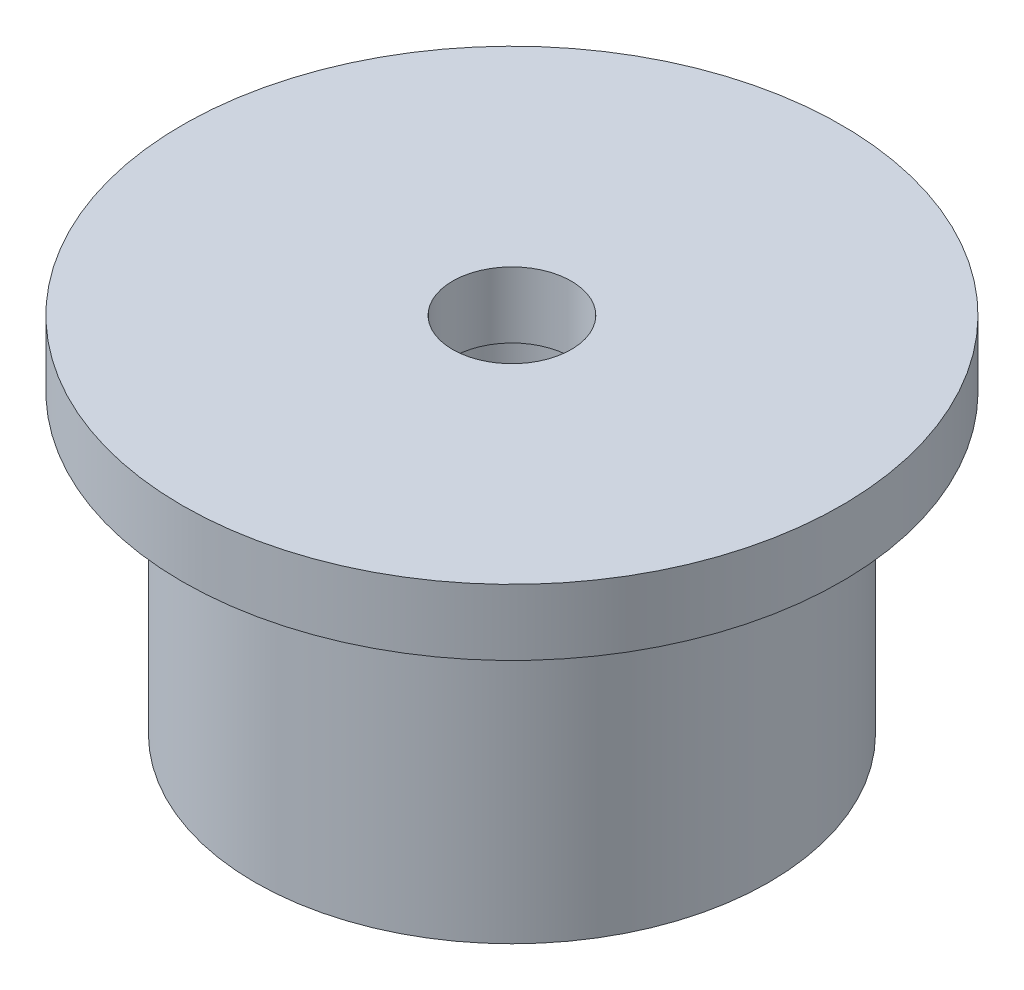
ISO-10303-21;
HEADER;
FILE_DESCRIPTION(('STEP AP214'),'2;1');
FILE_NAME('part.step','',(''),(''),'','','');
FILE_SCHEMA(('AUTOMOTIVE_DESIGN { 1 0 10303 214 1 1 1 1 }'));
ENDSEC;
DATA;
#1=APPLICATION_CONTEXT('core data for automotive mechanical design processes');
#2=APPLICATION_PROTOCOL_DEFINITION('international standard','automotive_design',2000,#1);
#3=PRODUCT_CONTEXT('',#1,'mechanical');
#4=PRODUCT('Part','Part','',(#3));
#5=PRODUCT_RELATED_PRODUCT_CATEGORY('part','',(#4));
#6=PRODUCT_DEFINITION_FORMATION('','',#4);
#7=PRODUCT_DEFINITION_CONTEXT('part definition',#1,'design');
#8=PRODUCT_DEFINITION('design','',#6,#7);
#9=PRODUCT_DEFINITION_SHAPE('','',#8);
#10=(LENGTH_UNIT() NAMED_UNIT(*) SI_UNIT(.MILLI.,.METRE.));
#11=(NAMED_UNIT(*) PLANE_ANGLE_UNIT() SI_UNIT($,.RADIAN.));
#12=(NAMED_UNIT(*) SI_UNIT($,.STERADIAN.) SOLID_ANGLE_UNIT());
#13=UNCERTAINTY_MEASURE_WITH_UNIT(LENGTH_MEASURE(1.E-05),#10,'distance_accuracy_value','');
#14=(GEOMETRIC_REPRESENTATION_CONTEXT(3) GLOBAL_UNCERTAINTY_ASSIGNED_CONTEXT((#13)) GLOBAL_UNIT_ASSIGNED_CONTEXT((#10,
#11,#12)) REPRESENTATION_CONTEXT('',''));
#15=CARTESIAN_POINT('',(0.,0.,0.));
#16=DIRECTION('',(0.,0.,1.));
#17=DIRECTION('',(1.,0.,0.));
#18=AXIS2_PLACEMENT_3D('',#15,#16,#17);
#19=CARTESIAN_POINT('',(0.,-0.5,0.));
#20=DIRECTION('',(0.,1.,0.));
#21=DIRECTION('',(0.,0.,1.));
#22=AXIS2_PLACEMENT_3D('',#19,#20,#21);
#23=PLANE('',#22);
#24=CARTESIAN_POINT('',(0.,-0.5,0.));
#25=DIRECTION('',(0.,1.,0.));
#26=DIRECTION('',(0.,0.,1.));
#27=AXIS2_PLACEMENT_3D('',#24,#25,#26);
#28=CIRCLE('',#27,5.);
#29=CARTESIAN_POINT('',(0.,-0.5,5.));
#30=VERTEX_POINT('',#29);
#31=EDGE_CURVE('E49',#30,#30,#28,.T.);
#32=ORIENTED_EDGE('',*,*,#31,.F.);
#33=EDGE_LOOP('',(#32));
#34=FACE_BOUND('',#33,.T.);
#35=CARTESIAN_POINT('',(0.,-0.5,0.));
#36=DIRECTION('',(0.,1.,0.));
#37=DIRECTION('',(0.,0.,1.));
#38=AXIS2_PLACEMENT_3D('',#35,#36,#37);
#39=CIRCLE('',#38,3.9);
#40=CARTESIAN_POINT('',(0.,-0.5,3.9));
#41=VERTEX_POINT('',#40);
#42=EDGE_CURVE('E42',#41,#41,#39,.F.);
#43=ORIENTED_EDGE('',*,*,#42,.F.);
#44=EDGE_LOOP('',(#43));
#45=FACE_BOUND('',#44,.T.);
#46=ADVANCED_FACE('F31',(#34,#45),#23,.F.);
#47=CARTESIAN_POINT('',(0.,0.5,0.));
#48=DIRECTION('',(0.,-1.,0.));
#49=DIRECTION('',(0.,0.,-1.));
#50=AXIS2_PLACEMENT_3D('',#47,#48,#49);
#51=CYLINDRICAL_SURFACE('',#50,5.);
#52=CARTESIAN_POINT('',(0.,0.5,0.));
#53=DIRECTION('',(0.,1.,0.));
#54=DIRECTION('',(0.,0.,1.));
#55=AXIS2_PLACEMENT_3D('',#52,#53,#54);
#56=CIRCLE('',#55,5.);
#57=CARTESIAN_POINT('',(0.,0.5,5.));
#58=VERTEX_POINT('',#57);
#59=EDGE_CURVE('E46',#58,#58,#56,.T.);
#60=ORIENTED_EDGE('',*,*,#59,.F.);
#61=EDGE_LOOP('',(#60));
#62=FACE_BOUND('',#61,.T.);
#63=ORIENTED_EDGE('',*,*,#31,.T.);
#64=EDGE_LOOP('',(#63));
#65=FACE_BOUND('',#64,.T.);
#66=ADVANCED_FACE('F73',(#62,#65),#51,.T.);
#67=CARTESIAN_POINT('',(0.,0.5,0.));
#68=DIRECTION('',(0.,1.,0.));
#69=DIRECTION('',(0.,0.,1.));
#70=AXIS2_PLACEMENT_3D('',#67,#68,#69);
#71=PLANE('',#70);
#72=CARTESIAN_POINT('',(0.,0.5,0.));
#73=DIRECTION('',(0.,1.,0.));
#74=DIRECTION('',(0.,0.,1.));
#75=AXIS2_PLACEMENT_3D('',#72,#73,#74);
#76=CIRCLE('',#75,0.9);
#77=CARTESIAN_POINT('',(0.,0.5,0.9));
#78=VERTEX_POINT('',#77);
#79=EDGE_CURVE('E60',#78,#78,#76,.T.);
#80=ORIENTED_EDGE('',*,*,#79,.F.);
#81=EDGE_LOOP('',(#80));
#82=FACE_BOUND('',#81,.T.);
#83=ORIENTED_EDGE('',*,*,#59,.T.);
#84=EDGE_LOOP('',(#83));
#85=FACE_BOUND('',#84,.T.);
#86=ADVANCED_FACE('F69',(#82,#85),#71,.T.);
#87=CARTESIAN_POINT('',(0.,-5.,0.));
#88=DIRECTION('',(0.,1.,0.));
#89=DIRECTION('',(0.,0.,1.));
#90=AXIS2_PLACEMENT_3D('',#87,#88,#89);
#91=CYLINDRICAL_SURFACE('',#90,3.9);
#92=CARTESIAN_POINT('',(0.,-5.,0.));
#93=DIRECTION('',(0.,-1.,0.));
#94=DIRECTION('',(0.,0.,-1.));
#95=AXIS2_PLACEMENT_3D('',#92,#93,#94);
#96=CIRCLE('',#95,3.9);
#97=CARTESIAN_POINT('',(0.,-5.,-3.9));
#98=VERTEX_POINT('',#97);
#99=EDGE_CURVE('E52',#98,#98,#96,.T.);
#100=ORIENTED_EDGE('',*,*,#99,.F.);
#101=EDGE_LOOP('',(#100));
#102=FACE_BOUND('',#101,.T.);
#103=ORIENTED_EDGE('',*,*,#42,.T.);
#104=EDGE_LOOP('',(#103));
#105=FACE_BOUND('',#104,.T.);
#106=ADVANCED_FACE('F72',(#102,#105),#91,.T.);
#107=CARTESIAN_POINT('',(0.,-5.,0.));
#108=DIRECTION('',(0.,-1.,0.));
#109=DIRECTION('',(0.,0.,-1.));
#110=AXIS2_PLACEMENT_3D('',#107,#108,#109);
#111=PLANE('',#110);
#112=CARTESIAN_POINT('',(0.,-5.,0.));
#113=DIRECTION('',(0.,-1.,0.));
#114=DIRECTION('',(0.,0.,-1.));
#115=AXIS2_PLACEMENT_3D('',#112,#113,#114);
#116=CIRCLE('',#115,1.2);
#117=CARTESIAN_POINT('',(0.,-5.,-1.2));
#118=VERTEX_POINT('',#117);
#119=EDGE_CURVE('E10',#118,#118,#116,.F.);
#120=ORIENTED_EDGE('',*,*,#119,.T.);
#121=EDGE_LOOP('',(#120));
#122=FACE_BOUND('',#121,.T.);
#123=ORIENTED_EDGE('',*,*,#99,.T.);
#124=EDGE_LOOP('',(#123));
#125=FACE_BOUND('',#124,.T.);
#126=ADVANCED_FACE('F87',(#122,#125),#111,.T.);
#127=CARTESIAN_POINT('',(0.,-0.5,0.));
#128=DIRECTION('',(0.,-1.,0.));
#129=DIRECTION('',(0.,0.,-1.));
#130=AXIS2_PLACEMENT_3D('',#127,#128,#129);
#131=CYLINDRICAL_SURFACE('',#130,1.);
#132=CARTESIAN_POINT('',(0.,-4.8,0.));
#133=DIRECTION('',(0.,-1.,0.));
#134=DIRECTION('',(0.,0.,-1.));
#135=AXIS2_PLACEMENT_3D('',#132,#133,#134);
#136=CIRCLE('',#135,1.);
#137=CARTESIAN_POINT('',(0.,-4.8,-1.));
#138=VERTEX_POINT('',#137);
#139=EDGE_CURVE('E38',#138,#138,#136,.T.);
#140=ORIENTED_EDGE('',*,*,#139,.T.);
#141=EDGE_LOOP('',(#140));
#142=FACE_BOUND('',#141,.T.);
#143=CARTESIAN_POINT('',(0.,-0.5,0.));
#144=DIRECTION('',(0.,-1.,0.));
#145=DIRECTION('',(0.,0.,-1.));
#146=AXIS2_PLACEMENT_3D('',#143,#144,#145);
#147=CIRCLE('',#146,1.);
#148=CARTESIAN_POINT('',(0.,-0.5,-1.));
#149=VERTEX_POINT('',#148);
#150=EDGE_CURVE('E57',#149,#149,#147,.T.);
#151=ORIENTED_EDGE('',*,*,#150,.F.);
#152=EDGE_LOOP('',(#151));
#153=FACE_BOUND('',#152,.T.);
#154=ADVANCED_FACE('F93',(#142,#153),#131,.F.);
#155=CARTESIAN_POINT('',(0.,-0.5,0.));
#156=DIRECTION('',(0.,-1.,0.));
#157=DIRECTION('',(0.,0.,-1.));
#158=AXIS2_PLACEMENT_3D('',#155,#156,#157);
#159=PLANE('',#158);
#160=CARTESIAN_POINT('',(0.,-0.5,0.));
#161=DIRECTION('',(0.,-1.,0.));
#162=DIRECTION('',(0.,0.,-1.));
#163=AXIS2_PLACEMENT_3D('',#160,#161,#162);
#164=CIRCLE('',#163,0.9);
#165=CARTESIAN_POINT('',(0.,-0.5,0.9));
#166=VERTEX_POINT('',#165);
#167=EDGE_CURVE('E61',#166,#166,#164,.F.);
#168=ORIENTED_EDGE('',*,*,#167,.T.);
#169=EDGE_LOOP('',(#168));
#170=FACE_BOUND('',#169,.T.);
#171=ORIENTED_EDGE('',*,*,#150,.T.);
#172=EDGE_LOOP('',(#171));
#173=FACE_BOUND('',#172,.T.);
#174=ADVANCED_FACE('F99',(#170,#173),#159,.T.);
#175=CARTESIAN_POINT('',(0.,-5.001,0.));
#176=DIRECTION('',(0.,1.,0.));
#177=DIRECTION('',(0.,0.,1.));
#178=AXIS2_PLACEMENT_3D('',#175,#176,#177);
#179=CYLINDRICAL_SURFACE('',#178,0.9);
#180=CARTESIAN_POINT('',(0.,-0.5,0.9));
#181=CARTESIAN_POINT('',(0.,-0.489583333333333,0.9));
#182=CARTESIAN_POINT('',(0.,-0.479166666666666,0.9));
#183=CARTESIAN_POINT('',(0.,-0.458333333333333,0.9));
#184=CARTESIAN_POINT('',(0.,-0.447916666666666,0.9));
#185=CARTESIAN_POINT('',(0.,-0.427083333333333,0.9));
#186=CARTESIAN_POINT('',(0.,-0.416666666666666,0.9));
#187=CARTESIAN_POINT('',(0.,-0.395833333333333,0.9));
#188=CARTESIAN_POINT('',(0.,-0.385416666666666,0.9));
#189=CARTESIAN_POINT('',(0.,-0.364583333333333,0.9));
#190=CARTESIAN_POINT('',(0.,-0.354166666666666,0.9));
#191=CARTESIAN_POINT('',(0.,-0.333333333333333,0.9));
#192=CARTESIAN_POINT('',(0.,-0.322916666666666,0.9));
#193=CARTESIAN_POINT('',(0.,-0.302083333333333,0.9));
#194=CARTESIAN_POINT('',(0.,-0.291666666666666,0.9));
#195=CARTESIAN_POINT('',(0.,-0.270833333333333,0.9));
#196=CARTESIAN_POINT('',(0.,-0.260416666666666,0.9));
#197=CARTESIAN_POINT('',(0.,-0.239583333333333,0.9));
#198=CARTESIAN_POINT('',(0.,-0.229166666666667,0.9));
#199=CARTESIAN_POINT('',(0.,-0.208333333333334,0.9));
#200=CARTESIAN_POINT('',(0.,-0.197916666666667,0.9));
#201=CARTESIAN_POINT('',(0.,-0.177083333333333,0.9));
#202=CARTESIAN_POINT('',(0.,-0.166666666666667,0.9));
#203=CARTESIAN_POINT('',(0.,-0.145833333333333,0.9));
#204=CARTESIAN_POINT('',(0.,-0.135416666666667,0.9));
#205=CARTESIAN_POINT('',(0.,-0.114583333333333,0.9));
#206=CARTESIAN_POINT('',(0.,-0.104166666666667,0.9));
#207=CARTESIAN_POINT('',(0.,-0.0833333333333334,0.9));
#208=CARTESIAN_POINT('',(0.,-0.0729166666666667,0.9));
#209=CARTESIAN_POINT('',(0.,-0.0520833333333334,0.9));
#210=CARTESIAN_POINT('',(0.,-0.0416666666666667,0.9));
#211=CARTESIAN_POINT('',(0.,-0.0208333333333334,0.9));
#212=CARTESIAN_POINT('',(0.,-0.0104166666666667,0.9));
#213=CARTESIAN_POINT('',(0.,0.0104166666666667,0.9));
#214=CARTESIAN_POINT('',(0.,0.0208333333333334,0.9));
#215=CARTESIAN_POINT('',(0.,0.0416666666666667,0.9));
#216=CARTESIAN_POINT('',(0.,0.0520833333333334,0.9));
#217=CARTESIAN_POINT('',(0.,0.0729166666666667,0.9));
#218=CARTESIAN_POINT('',(0.,0.0833333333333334,0.9));
#219=CARTESIAN_POINT('',(0.,0.104166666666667,0.9));
#220=CARTESIAN_POINT('',(0.,0.114583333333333,0.9));
#221=CARTESIAN_POINT('',(0.,0.135416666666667,0.9));
#222=CARTESIAN_POINT('',(0.,0.145833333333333,0.9));
#223=CARTESIAN_POINT('',(0.,0.166666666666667,0.9));
#224=CARTESIAN_POINT('',(0.,0.177083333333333,0.9));
#225=CARTESIAN_POINT('',(0.,0.197916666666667,0.9));
#226=CARTESIAN_POINT('',(0.,0.208333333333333,0.9));
#227=CARTESIAN_POINT('',(0.,0.229166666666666,0.9));
#228=CARTESIAN_POINT('',(0.,0.239583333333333,0.9));
#229=CARTESIAN_POINT('',(0.,0.260416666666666,0.9));
#230=CARTESIAN_POINT('',(0.,0.270833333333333,0.9));
#231=CARTESIAN_POINT('',(0.,0.291666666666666,0.9));
#232=CARTESIAN_POINT('',(0.,0.302083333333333,0.9));
#233=CARTESIAN_POINT('',(0.,0.322916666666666,0.9));
#234=CARTESIAN_POINT('',(0.,0.333333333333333,0.9));
#235=CARTESIAN_POINT('',(0.,0.354166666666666,0.9));
#236=CARTESIAN_POINT('',(0.,0.364583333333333,0.9));
#237=CARTESIAN_POINT('',(0.,0.385416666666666,0.9));
#238=CARTESIAN_POINT('',(0.,0.395833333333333,0.9));
#239=CARTESIAN_POINT('',(0.,0.416666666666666,0.9));
#240=CARTESIAN_POINT('',(0.,0.427083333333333,0.9));
#241=CARTESIAN_POINT('',(0.,0.447916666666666,0.9));
#242=CARTESIAN_POINT('',(0.,0.458333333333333,0.9));
#243=CARTESIAN_POINT('',(0.,0.479166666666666,0.9));
#244=CARTESIAN_POINT('',(0.,0.489583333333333,0.9));
#245=CARTESIAN_POINT('',(0.,0.5,0.9));
#246=B_SPLINE_CURVE_WITH_KNOTS('',3,(#180,#181,#182,#183,#184,#185,#186,#187,#188,#189,#190,
#191,#192,#193,#194,#195,#196,#197,#198,#199,#200,#201,#202,#203,#204,#205,#206,#207,#208,#209,
#210,#211,#212,#213,#214,#215,#216,#217,#218,#219,#220,#221,#222,#223,#224,#225,#226,#227,#228,
#229,#230,#231,#232,#233,#234,#235,#236,#237,#238,#239,#240,#241,#242,#243,#244,#245),
.UNSPECIFIED.,.F.,.F.,(4,2,2,2,2,2,2,2,2,2,2,2,2,2,2,2,2,2,2,2,2,2,2,2,2,2,2,2,2,2,2,2,4),(0.,
0.03125,0.0625000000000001,0.0937500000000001,0.125,0.15625,0.1875,0.21875,0.25,
0.281249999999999,0.312499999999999,0.343749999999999,0.374999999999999,0.40625,0.4375,0.46875,
0.5,0.53125,0.5625,0.59375,0.625,0.65625,0.6875,0.718749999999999,0.749999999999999,
0.781249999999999,0.812499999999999,0.843749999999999,0.874999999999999,0.906249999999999,
0.937499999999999,0.968749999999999,0.999999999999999),.UNSPECIFIED.);
#247=EDGE_CURVE('BSEAM67',#166,#78,#246,.T.);
#248=ORIENTED_EDGE('',*,*,#167,.F.);
#249=ORIENTED_EDGE('',*,*,#79,.T.);
#250=ORIENTED_EDGE('',*,*,#247,.T.);
#251=ORIENTED_EDGE('',*,*,#247,.F.);
#252=EDGE_LOOP('',(#248,#250,#249,#251));
#253=FACE_BOUND('',#252,.T.);
#254=ADVANCED_FACE('F67',(#253),#179,.F.);
#255=CARTESIAN_POINT('',(0.,-4.8,0.));
#256=DIRECTION('',(0.,-1.,0.));
#257=DIRECTION('',(0.,0.,-1.));
#258=AXIS2_PLACEMENT_3D('',#255,#256,#257);
#259=CONICAL_SURFACE('',#258,1.,0.785398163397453);
#260=ORIENTED_EDGE('',*,*,#119,.F.);
#261=EDGE_LOOP('',(#260));
#262=FACE_BOUND('',#261,.T.);
#263=ORIENTED_EDGE('',*,*,#139,.F.);
#264=EDGE_LOOP('',(#263));
#265=FACE_BOUND('',#264,.T.);
#266=ADVANCED_FACE('F33',(#262,#265),#259,.F.);
#267=CLOSED_SHELL('',(#46,#66,#86,#106,#126,#154,#174,#254,#266));
#268=MANIFOLD_SOLID_BREP('B2',#267);
#269=ADVANCED_BREP_SHAPE_REPRESENTATION('',(#18,#268),#14);
#270=SHAPE_DEFINITION_REPRESENTATION(#9,#269);
ENDSEC;
END-ISO-10303-21;
